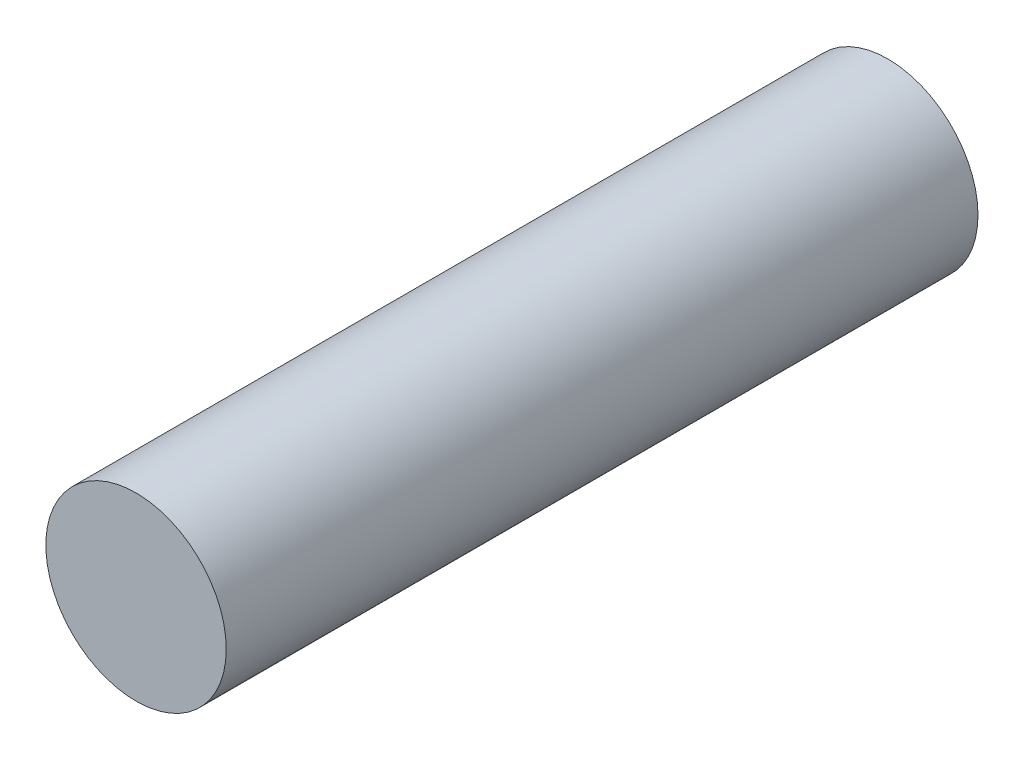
ISO-10303-21;
HEADER;
FILE_DESCRIPTION(('STEP AP214'),'2;1');
FILE_NAME('part.step','',(''),(''),'','','');
FILE_SCHEMA(('AUTOMOTIVE_DESIGN { 1 0 10303 214 1 1 1 1 }'));
ENDSEC;
DATA;
#1=APPLICATION_CONTEXT('core data for automotive mechanical design processes');
#2=APPLICATION_PROTOCOL_DEFINITION('international standard','automotive_design',2000,#1);
#3=PRODUCT_CONTEXT('',#1,'mechanical');
#4=PRODUCT('Part','Part','',(#3));
#5=PRODUCT_RELATED_PRODUCT_CATEGORY('part','',(#4));
#6=PRODUCT_DEFINITION_FORMATION('','',#4);
#7=PRODUCT_DEFINITION_CONTEXT('part definition',#1,'design');
#8=PRODUCT_DEFINITION('design','',#6,#7);
#9=PRODUCT_DEFINITION_SHAPE('','',#8);
#10=(LENGTH_UNIT() NAMED_UNIT(*) SI_UNIT(.MILLI.,.METRE.));
#11=(NAMED_UNIT(*) PLANE_ANGLE_UNIT() SI_UNIT($,.RADIAN.));
#12=(NAMED_UNIT(*) SI_UNIT($,.STERADIAN.) SOLID_ANGLE_UNIT());
#13=UNCERTAINTY_MEASURE_WITH_UNIT(LENGTH_MEASURE(1.E-05),#10,'distance_accuracy_value','');
#14=(GEOMETRIC_REPRESENTATION_CONTEXT(3) GLOBAL_UNCERTAINTY_ASSIGNED_CONTEXT((#13)) GLOBAL_UNIT_ASSIGNED_CONTEXT((#10,
#11,#12)) REPRESENTATION_CONTEXT('',''));
#15=CARTESIAN_POINT('',(0.,0.,0.));
#16=DIRECTION('',(0.,0.,1.));
#17=DIRECTION('',(1.,0.,0.));
#18=AXIS2_PLACEMENT_3D('',#15,#16,#17);
#19=CARTESIAN_POINT('',(-12.,0.,50.));
#20=DIRECTION('',(0.,0.,-1.));
#21=DIRECTION('',(-1.,0.,0.));
#22=AXIS2_PLACEMENT_3D('',#19,#20,#21);
#23=PLANE('',#22);
#24=CARTESIAN_POINT('',(0.,0.,50.));
#25=DIRECTION('',(0.,0.,1.));
#26=DIRECTION('',(1.,0.,0.));
#27=AXIS2_PLACEMENT_3D('',#24,#25,#26);
#28=CIRCLE('',#27,12.);
#29=CARTESIAN_POINT('',(12.,0.,50.));
#30=VERTEX_POINT('',#29);
#31=EDGE_CURVE('E30',#30,#30,#28,.T.);
#32=ORIENTED_EDGE('',*,*,#31,.T.);
#33=EDGE_LOOP('',(#32));
#34=FACE_BOUND('',#33,.T.);
#35=ADVANCED_FACE('F24',(#34),#23,.F.);
#36=CARTESIAN_POINT('',(0.,0.,-50.));
#37=DIRECTION('',(0.,0.,1.));
#38=DIRECTION('',(1.,0.,0.));
#39=AXIS2_PLACEMENT_3D('',#36,#37,#38);
#40=PLANE('',#39);
#41=CARTESIAN_POINT('',(0.,0.,-50.));
#42=DIRECTION('',(0.,0.,1.));
#43=DIRECTION('',(1.,0.,0.));
#44=AXIS2_PLACEMENT_3D('',#41,#42,#43);
#45=CIRCLE('',#44,12.);
#46=CARTESIAN_POINT('',(12.,0.,-50.));
#47=VERTEX_POINT('',#46);
#48=EDGE_CURVE('E10',#47,#47,#45,.T.);
#49=ORIENTED_EDGE('',*,*,#48,.F.);
#50=EDGE_LOOP('',(#49));
#51=FACE_BOUND('',#50,.T.);
#52=ADVANCED_FACE('F39',(#51),#40,.F.);
#53=CARTESIAN_POINT('',(0.,0.,50.));
#54=DIRECTION('',(0.,0.,1.));
#55=DIRECTION('',(1.,0.,0.));
#56=AXIS2_PLACEMENT_3D('',#53,#54,#55);
#57=CYLINDRICAL_SURFACE('',#56,12.);
#58=ORIENTED_EDGE('',*,*,#31,.F.);
#59=EDGE_LOOP('',(#58));
#60=FACE_BOUND('',#59,.T.);
#61=ORIENTED_EDGE('',*,*,#48,.T.);
#62=EDGE_LOOP('',(#61));
#63=FACE_BOUND('',#62,.T.);
#64=ADVANCED_FACE('F37',(#60,#63),#57,.T.);
#65=CLOSED_SHELL('',(#35,#52,#64));
#66=MANIFOLD_SOLID_BREP('B2',#65);
#67=ADVANCED_BREP_SHAPE_REPRESENTATION('',(#18,#66),#14);
#68=SHAPE_DEFINITION_REPRESENTATION(#9,#67);
ENDSEC;
END-ISO-10303-21;
